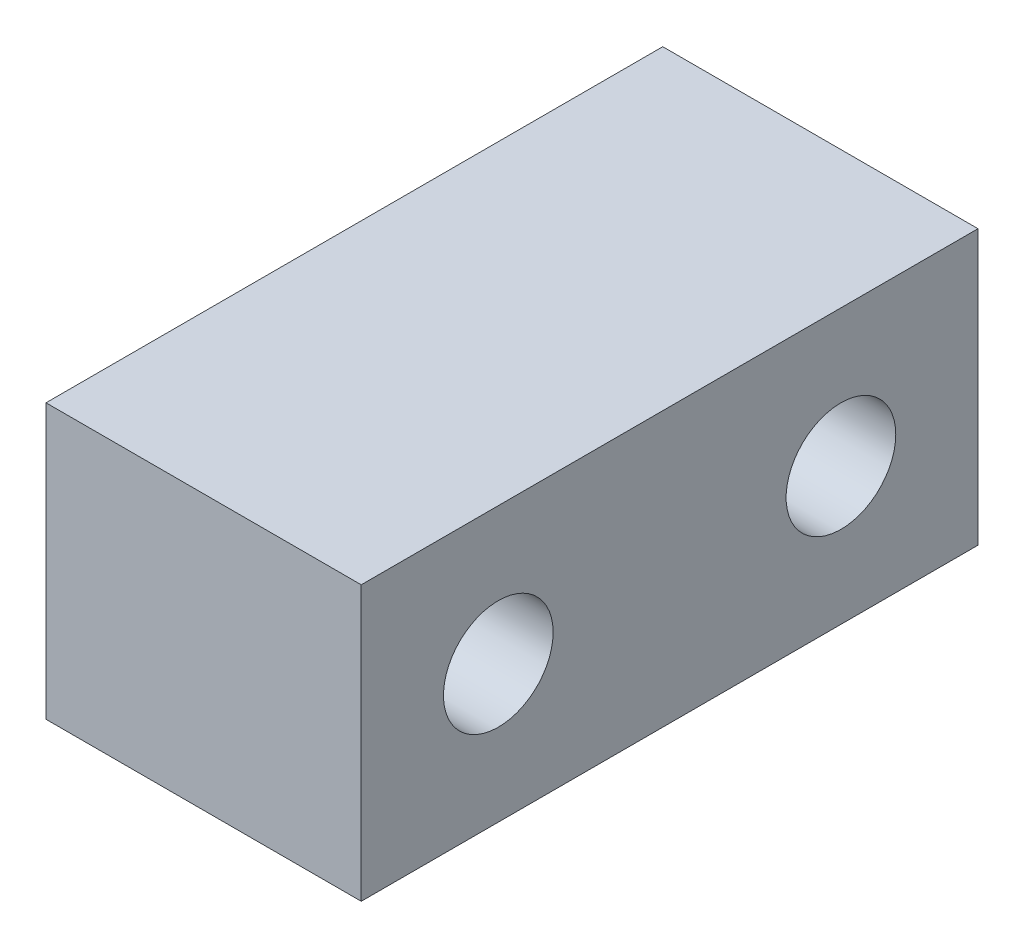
ISO-10303-21;
HEADER;
FILE_DESCRIPTION(('STEP AP214'),'2;1');
FILE_NAME('part.step','',(''),(''),'','','');
FILE_SCHEMA(('AUTOMOTIVE_DESIGN { 1 0 10303 214 1 1 1 1 }'));
ENDSEC;
DATA;
#1=APPLICATION_CONTEXT('core data for automotive mechanical design processes');
#2=APPLICATION_PROTOCOL_DEFINITION('international standard','automotive_design',2000,#1);
#3=PRODUCT_CONTEXT('',#1,'mechanical');
#4=PRODUCT('Part','Part','',(#3));
#5=PRODUCT_RELATED_PRODUCT_CATEGORY('part','',(#4));
#6=PRODUCT_DEFINITION_FORMATION('','',#4);
#7=PRODUCT_DEFINITION_CONTEXT('part definition',#1,'design');
#8=PRODUCT_DEFINITION('design','',#6,#7);
#9=PRODUCT_DEFINITION_SHAPE('','',#8);
#10=(LENGTH_UNIT() NAMED_UNIT(*) SI_UNIT(.MILLI.,.METRE.));
#11=(NAMED_UNIT(*) PLANE_ANGLE_UNIT() SI_UNIT($,.RADIAN.));
#12=(NAMED_UNIT(*) SI_UNIT($,.STERADIAN.) SOLID_ANGLE_UNIT());
#13=UNCERTAINTY_MEASURE_WITH_UNIT(LENGTH_MEASURE(1.E-05),#10,'distance_accuracy_value','');
#14=(GEOMETRIC_REPRESENTATION_CONTEXT(3) GLOBAL_UNCERTAINTY_ASSIGNED_CONTEXT((#13)) GLOBAL_UNIT_ASSIGNED_CONTEXT((#10,
#11,#12)) REPRESENTATION_CONTEXT('',''));
#15=CARTESIAN_POINT('',(0.,0.,0.));
#16=DIRECTION('',(0.,0.,1.));
#17=DIRECTION('',(1.,0.,0.));
#18=AXIS2_PLACEMENT_3D('',#15,#16,#17);
#19=CARTESIAN_POINT('',(0.,-11.2195121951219,-45.));
#20=DIRECTION('',(-1.,0.,0.));
#21=DIRECTION('',(0.,-1.,0.));
#22=AXIS2_PLACEMENT_3D('',#19,#20,#21);
#23=PLANE('',#22);
#24=CARTESIAN_POINT('',(0.,-21.219512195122,-10.));
#25=DIRECTION('',(1.,0.,0.));
#26=DIRECTION('',(0.,0.,-1.));
#27=AXIS2_PLACEMENT_3D('',#24,#25,#26);
#28=CIRCLE('',#27,4.);
#29=CARTESIAN_POINT('',(0.,-21.219512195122,-14.));
#30=VERTEX_POINT('',#29);
#31=EDGE_CURVE('E129',#30,#30,#28,.T.);
#32=ORIENTED_EDGE('',*,*,#31,.T.);
#33=EDGE_LOOP('',(#32));
#34=FACE_BOUND('',#33,.T.);
#35=CARTESIAN_POINT('',(0.,-21.219512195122,-35.));
#36=DIRECTION('',(1.,0.,0.));
#37=DIRECTION('',(0.,0.,-1.));
#38=AXIS2_PLACEMENT_3D('',#35,#36,#37);
#39=CIRCLE('',#38,4.);
#40=CARTESIAN_POINT('',(0.,-21.219512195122,-39.));
#41=VERTEX_POINT('',#40);
#42=EDGE_CURVE('E85',#41,#41,#39,.T.);
#43=ORIENTED_EDGE('',*,*,#42,.T.);
#44=EDGE_LOOP('',(#43));
#45=FACE_BOUND('',#44,.T.);
#46=DIRECTION('',(0.,-1.,0.));
#47=VECTOR('',#46,1.);
#48=CARTESIAN_POINT('',(0.,-11.2195121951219,0.));
#49=LINE('',#48,#47);
#50=CARTESIAN_POINT('',(0.,-11.2195121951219,0.));
#51=VERTEX_POINT('',#50);
#52=CARTESIAN_POINT('',(0.,-31.2195121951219,0.));
#53=VERTEX_POINT('',#52);
#54=EDGE_CURVE('E81',#51,#53,#49,.T.);
#55=ORIENTED_EDGE('',*,*,#54,.F.);
#56=DIRECTION('',(0.,0.,1.));
#57=VECTOR('',#56,1.);
#58=CARTESIAN_POINT('',(0.,-11.2195121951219,-45.));
#59=LINE('',#58,#57);
#60=CARTESIAN_POINT('',(0.,-11.2195121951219,-45.));
#61=VERTEX_POINT('',#60);
#62=EDGE_CURVE('E11',#61,#51,#59,.T.);
#63=ORIENTED_EDGE('',*,*,#62,.F.);
#64=DIRECTION('',(0.,-1.,0.));
#65=VECTOR('',#64,1.);
#66=CARTESIAN_POINT('',(0.,-11.2195121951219,-45.));
#67=LINE('',#66,#65);
#68=CARTESIAN_POINT('',(0.,-31.2195121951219,-45.));
#69=VERTEX_POINT('',#68);
#70=EDGE_CURVE('E74',#61,#69,#67,.T.);
#71=ORIENTED_EDGE('',*,*,#70,.T.);
#72=DIRECTION('',(0.,0.,1.));
#73=VECTOR('',#72,1.);
#74=CARTESIAN_POINT('',(0.,-31.2195121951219,-45.));
#75=LINE('',#74,#73);
#76=EDGE_CURVE('E19',#69,#53,#75,.T.);
#77=ORIENTED_EDGE('',*,*,#76,.T.);
#78=EDGE_LOOP('',(#55,#63,#71,#77));
#79=FACE_BOUND('',#78,.T.);
#80=ADVANCED_FACE('F16',(#34,#45,#79),#23,.T.);
#81=CARTESIAN_POINT('',(0.,-11.2195121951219,-45.));
#82=DIRECTION('',(0.,1.,0.));
#83=DIRECTION('',(0.,0.,1.));
#84=AXIS2_PLACEMENT_3D('',#81,#82,#83);
#85=PLANE('',#84);
#86=DIRECTION('',(-1.,0.,0.));
#87=VECTOR('',#86,1.);
#88=CARTESIAN_POINT('',(0.,-11.2195121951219,0.));
#89=LINE('',#88,#87);
#90=CARTESIAN_POINT('',(23.,-11.2195121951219,0.));
#91=VERTEX_POINT('',#90);
#92=EDGE_CURVE('E76',#91,#51,#89,.T.);
#93=ORIENTED_EDGE('',*,*,#92,.F.);
#94=DIRECTION('',(0.,0.,1.));
#95=VECTOR('',#94,1.);
#96=CARTESIAN_POINT('',(23.,-11.2195121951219,-45.));
#97=LINE('',#96,#95);
#98=CARTESIAN_POINT('',(23.,-11.2195121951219,-45.));
#99=VERTEX_POINT('',#98);
#100=EDGE_CURVE('E25',#99,#91,#97,.T.);
#101=ORIENTED_EDGE('',*,*,#100,.F.);
#102=DIRECTION('',(-1.,0.,0.));
#103=VECTOR('',#102,1.);
#104=CARTESIAN_POINT('',(0.,-11.2195121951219,-45.));
#105=LINE('',#104,#103);
#106=EDGE_CURVE('E71',#99,#61,#105,.T.);
#107=ORIENTED_EDGE('',*,*,#106,.T.);
#108=ORIENTED_EDGE('',*,*,#62,.T.);
#109=EDGE_LOOP('',(#93,#101,#107,#108));
#110=FACE_BOUND('',#109,.T.);
#111=ADVANCED_FACE('F92',(#110),#85,.T.);
#112=CARTESIAN_POINT('',(23.,-11.2195121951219,-45.));
#113=DIRECTION('',(1.,0.,0.));
#114=DIRECTION('',(0.,1.,0.));
#115=AXIS2_PLACEMENT_3D('',#112,#113,#114);
#116=PLANE('',#115);
#117=CARTESIAN_POINT('',(23.,-21.219512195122,-10.));
#118=DIRECTION('',(1.,0.,0.));
#119=DIRECTION('',(0.,0.,-1.));
#120=AXIS2_PLACEMENT_3D('',#117,#118,#119);
#121=CIRCLE('',#120,4.);
#122=CARTESIAN_POINT('',(23.,-21.219512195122,-14.));
#123=VERTEX_POINT('',#122);
#124=EDGE_CURVE('E132',#123,#123,#121,.T.);
#125=ORIENTED_EDGE('',*,*,#124,.F.);
#126=EDGE_LOOP('',(#125));
#127=FACE_BOUND('',#126,.T.);
#128=CARTESIAN_POINT('',(23.,-21.219512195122,-35.));
#129=DIRECTION('',(1.,0.,0.));
#130=DIRECTION('',(0.,0.,-1.));
#131=AXIS2_PLACEMENT_3D('',#128,#129,#130);
#132=CIRCLE('',#131,4.);
#133=CARTESIAN_POINT('',(23.,-21.219512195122,-39.));
#134=VERTEX_POINT('',#133);
#135=EDGE_CURVE('E134',#134,#134,#132,.T.);
#136=ORIENTED_EDGE('',*,*,#135,.F.);
#137=EDGE_LOOP('',(#136));
#138=FACE_BOUND('',#137,.T.);
#139=DIRECTION('',(0.,1.,0.));
#140=VECTOR('',#139,1.);
#141=CARTESIAN_POINT('',(23.,-11.2195121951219,0.));
#142=LINE('',#141,#140);
#143=CARTESIAN_POINT('',(23.,-31.2195121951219,0.));
#144=VERTEX_POINT('',#143);
#145=EDGE_CURVE('E66',#144,#91,#142,.T.);
#146=ORIENTED_EDGE('',*,*,#145,.F.);
#147=DIRECTION('',(0.,0.,1.));
#148=VECTOR('',#147,1.);
#149=CARTESIAN_POINT('',(23.,-31.2195121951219,-45.));
#150=LINE('',#149,#148);
#151=CARTESIAN_POINT('',(23.,-31.2195121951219,-45.));
#152=VERTEX_POINT('',#151);
#153=EDGE_CURVE('E61',#152,#144,#150,.T.);
#154=ORIENTED_EDGE('',*,*,#153,.F.);
#155=DIRECTION('',(0.,1.,0.));
#156=VECTOR('',#155,1.);
#157=CARTESIAN_POINT('',(23.,-11.2195121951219,-45.));
#158=LINE('',#157,#156);
#159=EDGE_CURVE('E64',#152,#99,#158,.T.);
#160=ORIENTED_EDGE('',*,*,#159,.T.);
#161=ORIENTED_EDGE('',*,*,#100,.T.);
#162=EDGE_LOOP('',(#146,#154,#160,#161));
#163=FACE_BOUND('',#162,.T.);
#164=ADVANCED_FACE('F63',(#127,#138,#163),#116,.T.);
#165=CARTESIAN_POINT('',(0.,-31.2195121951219,-45.));
#166=DIRECTION('',(0.,-1.,0.));
#167=DIRECTION('',(0.,0.,-1.));
#168=AXIS2_PLACEMENT_3D('',#165,#166,#167);
#169=PLANE('',#168);
#170=DIRECTION('',(1.,0.,0.));
#171=VECTOR('',#170,1.);
#172=CARTESIAN_POINT('',(0.,-31.2195121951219,0.));
#173=LINE('',#172,#171);
#174=EDGE_CURVE('E84',#53,#144,#173,.T.);
#175=ORIENTED_EDGE('',*,*,#174,.F.);
#176=ORIENTED_EDGE('',*,*,#76,.F.);
#177=DIRECTION('',(1.,0.,0.));
#178=VECTOR('',#177,1.);
#179=CARTESIAN_POINT('',(0.,-31.2195121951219,-45.));
#180=LINE('',#179,#178);
#181=EDGE_CURVE('E70',#69,#152,#180,.T.);
#182=ORIENTED_EDGE('',*,*,#181,.T.);
#183=ORIENTED_EDGE('',*,*,#153,.T.);
#184=EDGE_LOOP('',(#175,#176,#182,#183));
#185=FACE_BOUND('',#184,.T.);
#186=ADVANCED_FACE('F73',(#185),#169,.T.);
#187=CARTESIAN_POINT('',(0.,0.,-45.));
#188=DIRECTION('',(0.,0.,1.));
#189=DIRECTION('',(1.,0.,0.));
#190=AXIS2_PLACEMENT_3D('',#187,#188,#189);
#191=PLANE('',#190);
#192=ORIENTED_EDGE('',*,*,#70,.F.);
#193=ORIENTED_EDGE('',*,*,#106,.F.);
#194=ORIENTED_EDGE('',*,*,#159,.F.);
#195=ORIENTED_EDGE('',*,*,#181,.F.);
#196=EDGE_LOOP('',(#192,#193,#194,#195));
#197=FACE_BOUND('',#196,.T.);
#198=ADVANCED_FACE('F69',(#197),#191,.F.);
#199=CARTESIAN_POINT('',(0.,0.,0.));
#200=DIRECTION('',(0.,0.,1.));
#201=DIRECTION('',(1.,0.,0.));
#202=AXIS2_PLACEMENT_3D('',#199,#200,#201);
#203=PLANE('',#202);
#204=ORIENTED_EDGE('',*,*,#54,.T.);
#205=ORIENTED_EDGE('',*,*,#174,.T.);
#206=ORIENTED_EDGE('',*,*,#145,.T.);
#207=ORIENTED_EDGE('',*,*,#92,.T.);
#208=EDGE_LOOP('',(#204,#205,#206,#207));
#209=FACE_BOUND('',#208,.T.);
#210=ADVANCED_FACE('F91',(#209),#203,.T.);
#211=CARTESIAN_POINT('',(23.,-21.219512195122,-35.));
#212=DIRECTION('',(1.,0.,0.));
#213=DIRECTION('',(0.,0.,-1.));
#214=AXIS2_PLACEMENT_3D('',#211,#212,#213);
#215=CYLINDRICAL_SURFACE('',#214,4.);
#216=ORIENTED_EDGE('',*,*,#42,.F.);
#217=EDGE_LOOP('',(#216));
#218=FACE_BOUND('',#217,.T.);
#219=ORIENTED_EDGE('',*,*,#135,.T.);
#220=EDGE_LOOP('',(#219));
#221=FACE_BOUND('',#220,.T.);
#222=ADVANCED_FACE('F115',(#218,#221),#215,.F.);
#223=CARTESIAN_POINT('',(23.,-21.219512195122,-10.));
#224=DIRECTION('',(1.,0.,0.));
#225=DIRECTION('',(0.,0.,-1.));
#226=AXIS2_PLACEMENT_3D('',#223,#224,#225);
#227=CYLINDRICAL_SURFACE('',#226,4.);
#228=ORIENTED_EDGE('',*,*,#31,.F.);
#229=EDGE_LOOP('',(#228));
#230=FACE_BOUND('',#229,.T.);
#231=ORIENTED_EDGE('',*,*,#124,.T.);
#232=EDGE_LOOP('',(#231));
#233=FACE_BOUND('',#232,.T.);
#234=ADVANCED_FACE('F119',(#230,#233),#227,.F.);
#235=CLOSED_SHELL('',(#80,#111,#164,#186,#198,#210,#222,#234));
#236=MANIFOLD_SOLID_BREP('B1',#235);
#237=ADVANCED_BREP_SHAPE_REPRESENTATION('',(#18,#236),#14);
#238=SHAPE_DEFINITION_REPRESENTATION(#9,#237);
ENDSEC;
END-ISO-10303-21;
